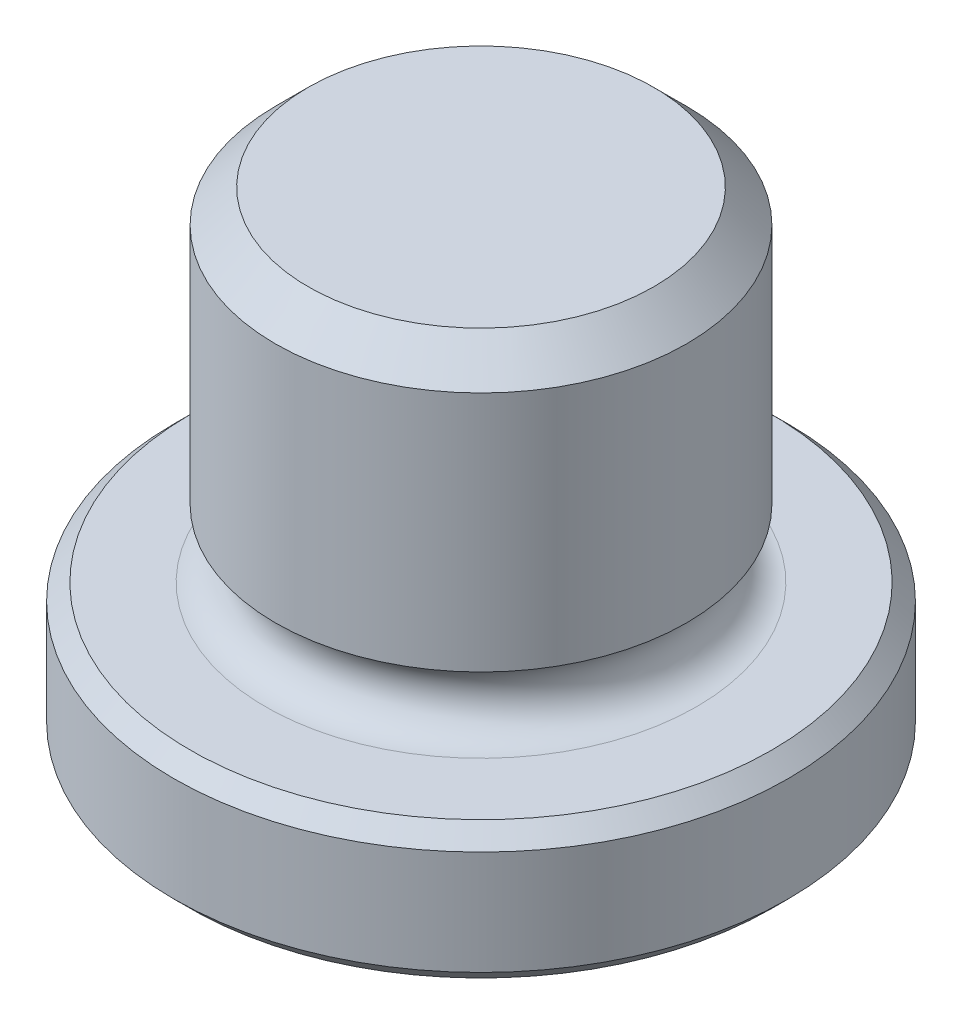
from build123d import *

# Parameters (mm, degrees)
CUT_EXTRUDE1_DEPTH = 7.874


with BuildPart() as part:
    # Sketch1 → Revolve1 (revolve)
    with BuildSketch(Plane.XY, mode=Mode.PRIVATE) as revolve1_sk:
        with BuildLine():
            Line((0, 0), (6.731, 0))
            Line((6.731, 0), (7.112, 0.381))
            Line((7.112, 0.381), (7.112, 2.794))
            Line((7.112, 2.794), (6.731, 3.175))
            Line((6.731, 3.175), (5.383494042, 3.175))
            Line((5.383494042, 3.175), (4.991, 3.175))
            ThreePointArc((4.991, 3.175), (4.203153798, 3.836081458), (4.717383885, 4.726754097))
            Line((4.717383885, 4.726754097), (4.7625, 4.743175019))
            Line((4.7625, 4.743175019), (4.7625, 10.3378))
            Line((4.7625, 10.3378), (4.0005, 11.0998))
            Line((4.0005, 11.0998), (0, 11.0998))
            Line((0, 11.0998), (0, 0))
        make_face()
    revolve(revolve1_sk.sketch.rotate(Axis((0, 11.0998, 0), (0, -1, 0)), 180), axis=Axis((0, 11.0998, 0), (0, -1, 0)))

    # Sketch2 → Cut-Extrude1 (cut)
    with BuildSketch(Plane.XZ):
        Polygon((-1.374815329, 2.38125), (-2.749630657, 0), (-1.374815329, -2.38125), (1.374815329, -2.38125), (2.749630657, 0), (1.374815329, 2.38125), align=None)
    extrude(amount=-CUT_EXTRUDE1_DEPTH, mode=Mode.SUBTRACT)

    # Sketch8 → Cut-Revolve1 (revolve, cut)
    with BuildSketch(Plane.XY, mode=Mode.PRIVATE) as cut_revolve1_sk:
        Polygon((-3.003630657, 0), (-1.479630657, 1.524), (0, 1.524), (0, 0), align=None)
    revolve(cut_revolve1_sk.sketch.rotate(Axis((0, 1.524, 0), (0, -1, 0)), 180), axis=Axis((0, 1.524, 0), (0, -1, 0)), mode=Mode.SUBTRACT)


solid = part.part
